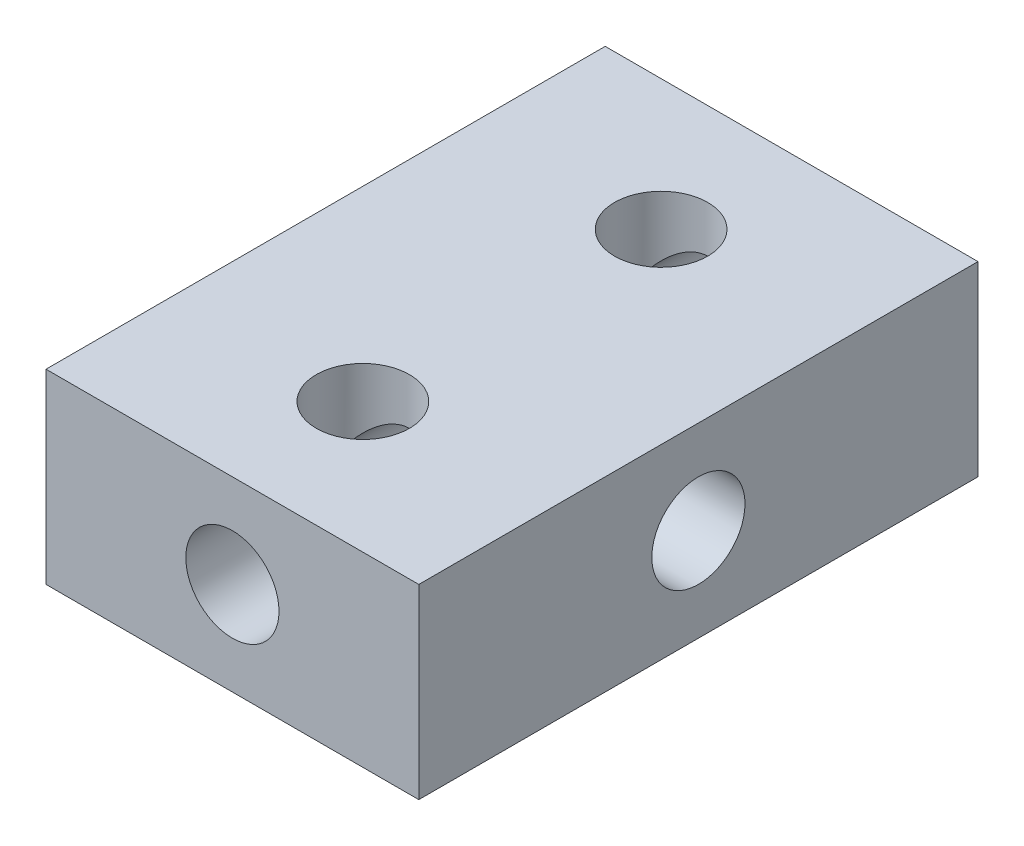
ISO-10303-21;
HEADER;
FILE_DESCRIPTION(('STEP AP214'),'2;1');
FILE_NAME('part.step','',(''),(''),'','','');
FILE_SCHEMA(('AUTOMOTIVE_DESIGN { 1 0 10303 214 1 1 1 1 }'));
ENDSEC;
DATA;
#1=APPLICATION_CONTEXT('core data for automotive mechanical design processes');
#2=APPLICATION_PROTOCOL_DEFINITION('international standard','automotive_design',2000,#1);
#3=PRODUCT_CONTEXT('',#1,'mechanical');
#4=PRODUCT('Part','Part','',(#3));
#5=PRODUCT_RELATED_PRODUCT_CATEGORY('part','',(#4));
#6=PRODUCT_DEFINITION_FORMATION('','',#4);
#7=PRODUCT_DEFINITION_CONTEXT('part definition',#1,'design');
#8=PRODUCT_DEFINITION('design','',#6,#7);
#9=PRODUCT_DEFINITION_SHAPE('','',#8);
#10=(LENGTH_UNIT() NAMED_UNIT(*) SI_UNIT(.MILLI.,.METRE.));
#11=(NAMED_UNIT(*) PLANE_ANGLE_UNIT() SI_UNIT($,.RADIAN.));
#12=(NAMED_UNIT(*) SI_UNIT($,.STERADIAN.) SOLID_ANGLE_UNIT());
#13=UNCERTAINTY_MEASURE_WITH_UNIT(LENGTH_MEASURE(1.E-05),#10,'distance_accuracy_value','');
#14=(GEOMETRIC_REPRESENTATION_CONTEXT(3) GLOBAL_UNCERTAINTY_ASSIGNED_CONTEXT((#13)) GLOBAL_UNIT_ASSIGNED_CONTEXT((#10,
#11,#12)) REPRESENTATION_CONTEXT('',''));
#15=CARTESIAN_POINT('',(0.,0.,0.));
#16=DIRECTION('',(0.,0.,1.));
#17=DIRECTION('',(1.,0.,0.));
#18=AXIS2_PLACEMENT_3D('',#15,#16,#17);
#19=CARTESIAN_POINT('',(5.,2.5,15.));
#20=DIRECTION('',(0.,0.,1.));
#21=DIRECTION('',(1.,0.,0.));
#22=AXIS2_PLACEMENT_3D('',#19,#20,#21);
#23=CYLINDRICAL_SURFACE('',#22,1.24999999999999);
#24=CARTESIAN_POINT('',(5.,2.5,15.));
#25=DIRECTION('',(0.,0.,1.));
#26=DIRECTION('',(1.,0.,0.));
#27=AXIS2_PLACEMENT_3D('',#24,#25,#26);
#28=CIRCLE('',#27,1.24999999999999);
#29=CARTESIAN_POINT('',(6.24999999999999,2.5,15.));
#30=VERTEX_POINT('',#29);
#31=EDGE_CURVE('E126',#30,#30,#28,.T.);
#32=ORIENTED_EDGE('',*,*,#31,.T.);
#33=EDGE_LOOP('',(#32));
#34=FACE_BOUND('',#33,.T.);
#35=CARTESIAN_POINT('',(5.,2.5,11.5));
#36=DIRECTION('',(0.,-0.707106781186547,0.707106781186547));
#37=DIRECTION('',(0.,0.707106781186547,0.707106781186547));
#38=AXIS2_PLACEMENT_3D('',#35,#36,#37);
#39=ELLIPSE('',#38,1.76776695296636,1.24999999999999);
#40=CARTESIAN_POINT('',(3.75000000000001,2.5,11.5));
#41=VERTEX_POINT('',#40);
#42=CARTESIAN_POINT('',(6.24999999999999,2.5,11.5));
#43=VERTEX_POINT('',#42);
#44=EDGE_CURVE('E49',#41,#43,#39,.F.);
#45=ORIENTED_EDGE('',*,*,#44,.T.);
#46=CARTESIAN_POINT('',(5.,2.5,11.5));
#47=DIRECTION('',(0.,0.707106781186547,0.707106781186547));
#48=DIRECTION('',(0.,-0.707106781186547,0.707106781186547));
#49=AXIS2_PLACEMENT_3D('',#46,#47,#48);
#50=ELLIPSE('',#49,1.76776695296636,1.24999999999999);
#51=EDGE_CURVE('E97',#43,#41,#50,.F.);
#52=ORIENTED_EDGE('',*,*,#51,.T.);
#53=EDGE_LOOP('',(#45,#52));
#54=FACE_BOUND('',#53,.T.);
#55=ADVANCED_FACE('F35',(#34,#54),#23,.F.);
#56=CARTESIAN_POINT('',(5.,2.5,7.5));
#57=DIRECTION('',(-0.707106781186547,0.,0.707106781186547));
#58=DIRECTION('',(0.707106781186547,0.,0.707106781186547));
#59=AXIS2_PLACEMENT_3D('',#56,#57,#58);
#60=ELLIPSE('',#59,1.76776695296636,1.24999999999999);
#61=CARTESIAN_POINT('',(5.,3.74999999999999,7.5));
#62=VERTEX_POINT('',#61);
#63=CARTESIAN_POINT('',(5.,1.25000000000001,7.5));
#64=VERTEX_POINT('',#63);
#65=EDGE_CURVE('E161',#62,#64,#60,.T.);
#66=ORIENTED_EDGE('',*,*,#65,.T.);
#67=CARTESIAN_POINT('',(5.,2.5,7.5));
#68=DIRECTION('',(0.707106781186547,0.,0.707106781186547));
#69=DIRECTION('',(-0.707106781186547,0.,0.707106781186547));
#70=AXIS2_PLACEMENT_3D('',#67,#68,#69);
#71=ELLIPSE('',#70,1.76776695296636,1.24999999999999);
#72=EDGE_CURVE('E164',#64,#62,#71,.T.);
#73=ORIENTED_EDGE('',*,*,#72,.T.);
#74=EDGE_LOOP('',(#66,#73));
#75=FACE_BOUND('',#74,.T.);
#76=CARTESIAN_POINT('',(5.,2.5,3.5));
#77=DIRECTION('',(0.,-0.707106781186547,0.707106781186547));
#78=DIRECTION('',(0.,0.707106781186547,0.707106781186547));
#79=AXIS2_PLACEMENT_3D('',#76,#77,#78);
#80=ELLIPSE('',#79,1.76776695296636,1.24999999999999);
#81=CARTESIAN_POINT('',(3.75000000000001,2.5,3.5));
#82=VERTEX_POINT('',#81);
#83=CARTESIAN_POINT('',(6.24999999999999,2.5,3.5));
#84=VERTEX_POINT('',#83);
#85=EDGE_CURVE('E55',#82,#84,#80,.F.);
#86=ORIENTED_EDGE('',*,*,#85,.T.);
#87=CARTESIAN_POINT('',(5.,2.5,3.5));
#88=DIRECTION('',(0.,0.707106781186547,0.707106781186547));
#89=DIRECTION('',(0.,-0.707106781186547,0.707106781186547));
#90=AXIS2_PLACEMENT_3D('',#87,#88,#89);
#91=ELLIPSE('',#90,1.76776695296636,1.24999999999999);
#92=EDGE_CURVE('E11',#84,#82,#91,.F.);
#93=ORIENTED_EDGE('',*,*,#92,.T.);
#94=EDGE_LOOP('',(#86,#93));
#95=FACE_BOUND('',#94,.T.);
#96=ADVANCED_FACE('F182',(#75,#95),#23,.F.);
#97=CARTESIAN_POINT('',(5.,2.5,11.5));
#98=DIRECTION('',(0.,-0.707106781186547,0.707106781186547));
#99=DIRECTION('',(0.,0.707106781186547,0.707106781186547));
#100=AXIS2_PLACEMENT_3D('',#97,#98,#99);
#101=ELLIPSE('',#100,1.76776695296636,1.24999999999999);
#102=EDGE_CURVE('E95',#41,#43,#101,.T.);
#103=ORIENTED_EDGE('',*,*,#102,.T.);
#104=CARTESIAN_POINT('',(5.,2.5,11.5));
#105=DIRECTION('',(0.,0.707106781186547,0.707106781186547));
#106=DIRECTION('',(0.,-0.707106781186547,0.707106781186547));
#107=AXIS2_PLACEMENT_3D('',#104,#105,#106);
#108=ELLIPSE('',#107,1.76776695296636,1.24999999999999);
#109=EDGE_CURVE('E100',#43,#41,#108,.T.);
#110=ORIENTED_EDGE('',*,*,#109,.T.);
#111=EDGE_LOOP('',(#103,#110));
#112=FACE_BOUND('',#111,.T.);
#113=CARTESIAN_POINT('',(5.,2.5,7.5));
#114=DIRECTION('',(-0.707106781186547,0.,0.707106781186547));
#115=DIRECTION('',(0.707106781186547,0.,0.707106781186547));
#116=AXIS2_PLACEMENT_3D('',#113,#114,#115);
#117=ELLIPSE('',#116,1.76776695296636,1.24999999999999);
#118=EDGE_CURVE('E159',#62,#64,#117,.F.);
#119=ORIENTED_EDGE('',*,*,#118,.T.);
#120=CARTESIAN_POINT('',(5.,2.5,7.5));
#121=DIRECTION('',(0.707106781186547,0.,0.707106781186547));
#122=DIRECTION('',(-0.707106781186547,0.,0.707106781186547));
#123=AXIS2_PLACEMENT_3D('',#120,#121,#122);
#124=ELLIPSE('',#123,1.76776695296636,1.24999999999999);
#125=EDGE_CURVE('E167',#64,#62,#124,.F.);
#126=ORIENTED_EDGE('',*,*,#125,.T.);
#127=EDGE_LOOP('',(#119,#126));
#128=FACE_BOUND('',#127,.T.);
#129=ADVANCED_FACE('F108',(#112,#128),#23,.F.);
#130=CARTESIAN_POINT('',(0.,5.,15.));
#131=DIRECTION('',(1.,0.,0.));
#132=DIRECTION('',(0.,1.,0.));
#133=AXIS2_PLACEMENT_3D('',#130,#131,#132);
#134=PLANE('',#133);
#135=CARTESIAN_POINT('',(0.,2.5,7.5));
#136=DIRECTION('',(1.,0.,0.));
#137=DIRECTION('',(0.,0.,-1.));
#138=AXIS2_PLACEMENT_3D('',#135,#136,#137);
#139=CIRCLE('',#138,1.25);
#140=CARTESIAN_POINT('',(0.,2.5,6.25));
#141=VERTEX_POINT('',#140);
#142=EDGE_CURVE('E117',#141,#141,#139,.T.);
#143=ORIENTED_EDGE('',*,*,#142,.T.);
#144=EDGE_LOOP('',(#143));
#145=FACE_BOUND('',#144,.T.);
#146=DIRECTION('',(0.,-1.,0.));
#147=VECTOR('',#146,1.);
#148=CARTESIAN_POINT('',(0.,5.,0.));
#149=LINE('',#148,#147);
#150=CARTESIAN_POINT('',(0.,5.,0.));
#151=VERTEX_POINT('',#150);
#152=CARTESIAN_POINT('',(0.,0.,0.));
#153=VERTEX_POINT('',#152);
#154=EDGE_CURVE('E129',#151,#153,#149,.T.);
#155=ORIENTED_EDGE('',*,*,#154,.T.);
#156=DIRECTION('',(0.,0.,-1.));
#157=VECTOR('',#156,1.);
#158=CARTESIAN_POINT('',(0.,0.,15.));
#159=LINE('',#158,#157);
#160=CARTESIAN_POINT('',(0.,0.,15.));
#161=VERTEX_POINT('',#160);
#162=EDGE_CURVE('E156',#161,#153,#159,.T.);
#163=ORIENTED_EDGE('',*,*,#162,.F.);
#164=DIRECTION('',(0.,-1.,0.));
#165=VECTOR('',#164,1.);
#166=CARTESIAN_POINT('',(0.,5.,15.));
#167=LINE('',#166,#165);
#168=CARTESIAN_POINT('',(0.,5.,15.));
#169=VERTEX_POINT('',#168);
#170=EDGE_CURVE('E138',#169,#161,#167,.T.);
#171=ORIENTED_EDGE('',*,*,#170,.F.);
#172=DIRECTION('',(0.,0.,-1.));
#173=VECTOR('',#172,1.);
#174=CARTESIAN_POINT('',(0.,5.,15.));
#175=LINE('',#174,#173);
#176=EDGE_CURVE('E147',#169,#151,#175,.T.);
#177=ORIENTED_EDGE('',*,*,#176,.T.);
#178=EDGE_LOOP('',(#155,#163,#171,#177));
#179=FACE_BOUND('',#178,.T.);
#180=ADVANCED_FACE('F37',(#145,#179),#134,.F.);
#181=CARTESIAN_POINT('',(0.,0.,15.));
#182=DIRECTION('',(0.,1.,0.));
#183=DIRECTION('',(0.,0.,1.));
#184=AXIS2_PLACEMENT_3D('',#181,#182,#183);
#185=PLANE('',#184);
#186=CARTESIAN_POINT('',(5.,0.,11.5));
#187=DIRECTION('',(0.,1.,0.));
#188=DIRECTION('',(0.,0.,1.));
#189=AXIS2_PLACEMENT_3D('',#186,#187,#188);
#190=CIRCLE('',#189,1.25);
#191=CARTESIAN_POINT('',(5.,0.,12.75));
#192=VERTEX_POINT('',#191);
#193=EDGE_CURVE('E222',#192,#192,#190,.T.);
#194=ORIENTED_EDGE('',*,*,#193,.T.);
#195=EDGE_LOOP('',(#194));
#196=FACE_BOUND('',#195,.T.);
#197=CARTESIAN_POINT('',(5.,0.,3.5));
#198=DIRECTION('',(0.,1.,0.));
#199=DIRECTION('',(0.,0.,1.));
#200=AXIS2_PLACEMENT_3D('',#197,#198,#199);
#201=CIRCLE('',#200,1.25);
#202=CARTESIAN_POINT('',(5.,0.,4.75));
#203=VERTEX_POINT('',#202);
#204=EDGE_CURVE('E106',#203,#203,#201,.T.);
#205=ORIENTED_EDGE('',*,*,#204,.T.);
#206=EDGE_LOOP('',(#205));
#207=FACE_BOUND('',#206,.T.);
#208=DIRECTION('',(1.,0.,0.));
#209=VECTOR('',#208,1.);
#210=CARTESIAN_POINT('',(0.,0.,0.));
#211=LINE('',#210,#209);
#212=CARTESIAN_POINT('',(10.,0.,0.));
#213=VERTEX_POINT('',#212);
#214=EDGE_CURVE('E132',#153,#213,#211,.T.);
#215=ORIENTED_EDGE('',*,*,#214,.T.);
#216=DIRECTION('',(0.,0.,-1.));
#217=VECTOR('',#216,1.);
#218=CARTESIAN_POINT('',(10.,0.,15.));
#219=LINE('',#218,#217);
#220=CARTESIAN_POINT('',(10.,0.,15.));
#221=VERTEX_POINT('',#220);
#222=EDGE_CURVE('E153',#221,#213,#219,.T.);
#223=ORIENTED_EDGE('',*,*,#222,.F.);
#224=DIRECTION('',(1.,0.,0.));
#225=VECTOR('',#224,1.);
#226=CARTESIAN_POINT('',(0.,0.,15.));
#227=LINE('',#226,#225);
#228=EDGE_CURVE('E141',#161,#221,#227,.T.);
#229=ORIENTED_EDGE('',*,*,#228,.F.);
#230=ORIENTED_EDGE('',*,*,#162,.T.);
#231=EDGE_LOOP('',(#215,#223,#229,#230));
#232=FACE_BOUND('',#231,.T.);
#233=ADVANCED_FACE('F211',(#196,#207,#232),#185,.F.);
#234=CARTESIAN_POINT('',(10.,5.,15.));
#235=DIRECTION('',(-1.,0.,0.));
#236=DIRECTION('',(0.,0.,1.));
#237=AXIS2_PLACEMENT_3D('',#234,#235,#236);
#238=PLANE('',#237);
#239=CARTESIAN_POINT('',(10.,2.5,7.5));
#240=DIRECTION('',(1.,0.,0.));
#241=DIRECTION('',(0.,0.,-1.));
#242=AXIS2_PLACEMENT_3D('',#239,#240,#241);
#243=CIRCLE('',#242,1.24999999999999);
#244=CARTESIAN_POINT('',(10.,2.5,6.25000000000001));
#245=VERTEX_POINT('',#244);
#246=EDGE_CURVE('E120',#245,#245,#243,.T.);
#247=ORIENTED_EDGE('',*,*,#246,.F.);
#248=EDGE_LOOP('',(#247));
#249=FACE_BOUND('',#248,.T.);
#250=DIRECTION('',(0.,1.,0.));
#251=VECTOR('',#250,1.);
#252=CARTESIAN_POINT('',(10.,5.,0.));
#253=LINE('',#252,#251);
#254=CARTESIAN_POINT('',(10.,5.,0.));
#255=VERTEX_POINT('',#254);
#256=EDGE_CURVE('E134',#213,#255,#253,.T.);
#257=ORIENTED_EDGE('',*,*,#256,.T.);
#258=DIRECTION('',(0.,0.,-1.));
#259=VECTOR('',#258,1.);
#260=CARTESIAN_POINT('',(10.,5.,15.));
#261=LINE('',#260,#259);
#262=CARTESIAN_POINT('',(10.,5.,15.));
#263=VERTEX_POINT('',#262);
#264=EDGE_CURVE('E150',#263,#255,#261,.T.);
#265=ORIENTED_EDGE('',*,*,#264,.F.);
#266=DIRECTION('',(0.,1.,0.));
#267=VECTOR('',#266,1.);
#268=CARTESIAN_POINT('',(10.,5.,15.));
#269=LINE('',#268,#267);
#270=EDGE_CURVE('E143',#221,#263,#269,.T.);
#271=ORIENTED_EDGE('',*,*,#270,.F.);
#272=ORIENTED_EDGE('',*,*,#222,.T.);
#273=EDGE_LOOP('',(#257,#265,#271,#272));
#274=FACE_BOUND('',#273,.T.);
#275=ADVANCED_FACE('F208',(#249,#274),#238,.F.);
#276=CARTESIAN_POINT('',(0.,5.,15.));
#277=DIRECTION('',(0.,-1.,0.));
#278=DIRECTION('',(0.,0.,-1.));
#279=AXIS2_PLACEMENT_3D('',#276,#277,#278);
#280=PLANE('',#279);
#281=CARTESIAN_POINT('',(5.,5.,11.5));
#282=DIRECTION('',(0.,1.,0.));
#283=DIRECTION('',(0.,0.,1.));
#284=AXIS2_PLACEMENT_3D('',#281,#282,#283);
#285=CIRCLE('',#284,1.24999999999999);
#286=CARTESIAN_POINT('',(5.,5.,12.75));
#287=VERTEX_POINT('',#286);
#288=EDGE_CURVE('E104',#287,#287,#285,.T.);
#289=ORIENTED_EDGE('',*,*,#288,.F.);
#290=EDGE_LOOP('',(#289));
#291=FACE_BOUND('',#290,.T.);
#292=CARTESIAN_POINT('',(5.,5.,3.5));
#293=DIRECTION('',(0.,1.,0.));
#294=DIRECTION('',(0.,0.,1.));
#295=AXIS2_PLACEMENT_3D('',#292,#293,#294);
#296=CIRCLE('',#295,1.24999999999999);
#297=CARTESIAN_POINT('',(5.,5.,4.74999999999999));
#298=VERTEX_POINT('',#297);
#299=EDGE_CURVE('E114',#298,#298,#296,.T.);
#300=ORIENTED_EDGE('',*,*,#299,.F.);
#301=EDGE_LOOP('',(#300));
#302=FACE_BOUND('',#301,.T.);
#303=DIRECTION('',(-1.,0.,0.));
#304=VECTOR('',#303,1.);
#305=CARTESIAN_POINT('',(0.,5.,0.));
#306=LINE('',#305,#304);
#307=EDGE_CURVE('E136',#255,#151,#306,.T.);
#308=ORIENTED_EDGE('',*,*,#307,.T.);
#309=ORIENTED_EDGE('',*,*,#176,.F.);
#310=DIRECTION('',(-1.,0.,0.));
#311=VECTOR('',#310,1.);
#312=CARTESIAN_POINT('',(0.,5.,15.));
#313=LINE('',#312,#311);
#314=EDGE_CURVE('E145',#263,#169,#313,.T.);
#315=ORIENTED_EDGE('',*,*,#314,.F.);
#316=ORIENTED_EDGE('',*,*,#264,.T.);
#317=EDGE_LOOP('',(#308,#309,#315,#316));
#318=FACE_BOUND('',#317,.T.);
#319=ADVANCED_FACE('F204',(#291,#302,#318),#280,.F.);
#320=CARTESIAN_POINT('',(0.,0.,15.));
#321=DIRECTION('',(0.,0.,1.));
#322=DIRECTION('',(1.,0.,0.));
#323=AXIS2_PLACEMENT_3D('',#320,#321,#322);
#324=PLANE('',#323);
#325=ORIENTED_EDGE('',*,*,#31,.F.);
#326=EDGE_LOOP('',(#325));
#327=FACE_BOUND('',#326,.T.);
#328=ORIENTED_EDGE('',*,*,#170,.T.);
#329=ORIENTED_EDGE('',*,*,#228,.T.);
#330=ORIENTED_EDGE('',*,*,#270,.T.);
#331=ORIENTED_EDGE('',*,*,#314,.T.);
#332=EDGE_LOOP('',(#328,#329,#330,#331));
#333=FACE_BOUND('',#332,.T.);
#334=ADVANCED_FACE('F200',(#327,#333),#324,.T.);
#335=CARTESIAN_POINT('',(0.,0.,0.));
#336=DIRECTION('',(0.,0.,1.));
#337=DIRECTION('',(1.,0.,0.));
#338=AXIS2_PLACEMENT_3D('',#335,#336,#337);
#339=PLANE('',#338);
#340=CARTESIAN_POINT('',(5.,2.5,0.));
#341=DIRECTION('',(0.,0.,1.));
#342=DIRECTION('',(1.,0.,0.));
#343=AXIS2_PLACEMENT_3D('',#340,#341,#342);
#344=CIRCLE('',#343,1.25);
#345=CARTESIAN_POINT('',(6.25,2.5,0.));
#346=VERTEX_POINT('',#345);
#347=EDGE_CURVE('E123',#346,#346,#344,.T.);
#348=ORIENTED_EDGE('',*,*,#347,.T.);
#349=EDGE_LOOP('',(#348));
#350=FACE_BOUND('',#349,.T.);
#351=ORIENTED_EDGE('',*,*,#154,.F.);
#352=ORIENTED_EDGE('',*,*,#307,.F.);
#353=ORIENTED_EDGE('',*,*,#256,.F.);
#354=ORIENTED_EDGE('',*,*,#214,.F.);
#355=EDGE_LOOP('',(#351,#352,#353,#354));
#356=FACE_BOUND('',#355,.T.);
#357=ADVANCED_FACE('F195',(#350,#356),#339,.F.);
#358=CARTESIAN_POINT('',(5.,2.5,3.5));
#359=DIRECTION('',(0.,-0.707106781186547,0.707106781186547));
#360=DIRECTION('',(0.,0.707106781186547,0.707106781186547));
#361=AXIS2_PLACEMENT_3D('',#358,#359,#360);
#362=ELLIPSE('',#361,1.76776695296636,1.24999999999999);
#363=EDGE_CURVE('E171',#82,#84,#362,.T.);
#364=ORIENTED_EDGE('',*,*,#363,.T.);
#365=CARTESIAN_POINT('',(5.,2.5,3.5));
#366=DIRECTION('',(0.,0.707106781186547,0.707106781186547));
#367=DIRECTION('',(0.,-0.707106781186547,0.707106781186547));
#368=AXIS2_PLACEMENT_3D('',#365,#366,#367);
#369=ELLIPSE('',#368,1.76776695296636,1.24999999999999);
#370=EDGE_CURVE('E43',#84,#82,#369,.T.);
#371=ORIENTED_EDGE('',*,*,#370,.T.);
#372=EDGE_LOOP('',(#364,#371));
#373=FACE_BOUND('',#372,.T.);
#374=ORIENTED_EDGE('',*,*,#347,.F.);
#375=EDGE_LOOP('',(#374));
#376=FACE_BOUND('',#375,.T.);
#377=ADVANCED_FACE('F175',(#373,#376),#23,.F.);
#378=CARTESIAN_POINT('',(10.,2.5,7.5));
#379=DIRECTION('',(1.,0.,0.));
#380=DIRECTION('',(0.,0.,-1.));
#381=AXIS2_PLACEMENT_3D('',#378,#379,#380);
#382=CYLINDRICAL_SURFACE('',#381,1.24999999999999);
#383=ORIENTED_EDGE('',*,*,#246,.T.);
#384=EDGE_LOOP('',(#383));
#385=FACE_BOUND('',#384,.T.);
#386=ORIENTED_EDGE('',*,*,#118,.F.);
#387=ORIENTED_EDGE('',*,*,#72,.F.);
#388=EDGE_LOOP('',(#386,#387));
#389=FACE_BOUND('',#388,.T.);
#390=ADVANCED_FACE('F194',(#385,#389),#382,.F.);
#391=ORIENTED_EDGE('',*,*,#142,.F.);
#392=EDGE_LOOP('',(#391));
#393=FACE_BOUND('',#392,.T.);
#394=ORIENTED_EDGE('',*,*,#65,.F.);
#395=ORIENTED_EDGE('',*,*,#125,.F.);
#396=EDGE_LOOP('',(#394,#395));
#397=FACE_BOUND('',#396,.T.);
#398=ADVANCED_FACE('F196',(#393,#397),#382,.F.);
#399=CARTESIAN_POINT('',(5.,5.,3.5));
#400=DIRECTION('',(0.,1.,0.));
#401=DIRECTION('',(0.,0.,1.));
#402=AXIS2_PLACEMENT_3D('',#399,#400,#401);
#403=CYLINDRICAL_SURFACE('',#402,1.24999999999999);
#404=ORIENTED_EDGE('',*,*,#299,.T.);
#405=EDGE_LOOP('',(#404));
#406=FACE_BOUND('',#405,.T.);
#407=ORIENTED_EDGE('',*,*,#85,.F.);
#408=ORIENTED_EDGE('',*,*,#370,.F.);
#409=EDGE_LOOP('',(#407,#408));
#410=FACE_BOUND('',#409,.T.);
#411=ADVANCED_FACE('F179',(#406,#410),#403,.F.);
#412=ORIENTED_EDGE('',*,*,#204,.F.);
#413=EDGE_LOOP('',(#412));
#414=FACE_BOUND('',#413,.T.);
#415=ORIENTED_EDGE('',*,*,#363,.F.);
#416=ORIENTED_EDGE('',*,*,#92,.F.);
#417=EDGE_LOOP('',(#415,#416));
#418=FACE_BOUND('',#417,.T.);
#419=ADVANCED_FACE('F181',(#414,#418),#403,.F.);
#420=CARTESIAN_POINT('',(5.,5.,11.5));
#421=DIRECTION('',(0.,1.,0.));
#422=DIRECTION('',(0.,0.,1.));
#423=AXIS2_PLACEMENT_3D('',#420,#421,#422);
#424=CYLINDRICAL_SURFACE('',#423,1.24999999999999);
#425=ORIENTED_EDGE('',*,*,#288,.T.);
#426=EDGE_LOOP('',(#425));
#427=FACE_BOUND('',#426,.T.);
#428=ORIENTED_EDGE('',*,*,#44,.F.);
#429=ORIENTED_EDGE('',*,*,#109,.F.);
#430=EDGE_LOOP('',(#428,#429));
#431=FACE_BOUND('',#430,.T.);
#432=ADVANCED_FACE('F103',(#427,#431),#424,.F.);
#433=ORIENTED_EDGE('',*,*,#193,.F.);
#434=EDGE_LOOP('',(#433));
#435=FACE_BOUND('',#434,.T.);
#436=ORIENTED_EDGE('',*,*,#102,.F.);
#437=ORIENTED_EDGE('',*,*,#51,.F.);
#438=EDGE_LOOP('',(#436,#437));
#439=FACE_BOUND('',#438,.T.);
#440=ADVANCED_FACE('F96',(#435,#439),#424,.F.);
#441=CLOSED_SHELL('',(#55,#96,#129,#180,#233,#275,#319,#334,#357,#377,#390,#398,#411,#419,#432,#440));
#442=MANIFOLD_SOLID_BREP('B2',#441);
#443=ADVANCED_BREP_SHAPE_REPRESENTATION('',(#18,#442),#14);
#444=SHAPE_DEFINITION_REPRESENTATION(#9,#443);
ENDSEC;
END-ISO-10303-21;
